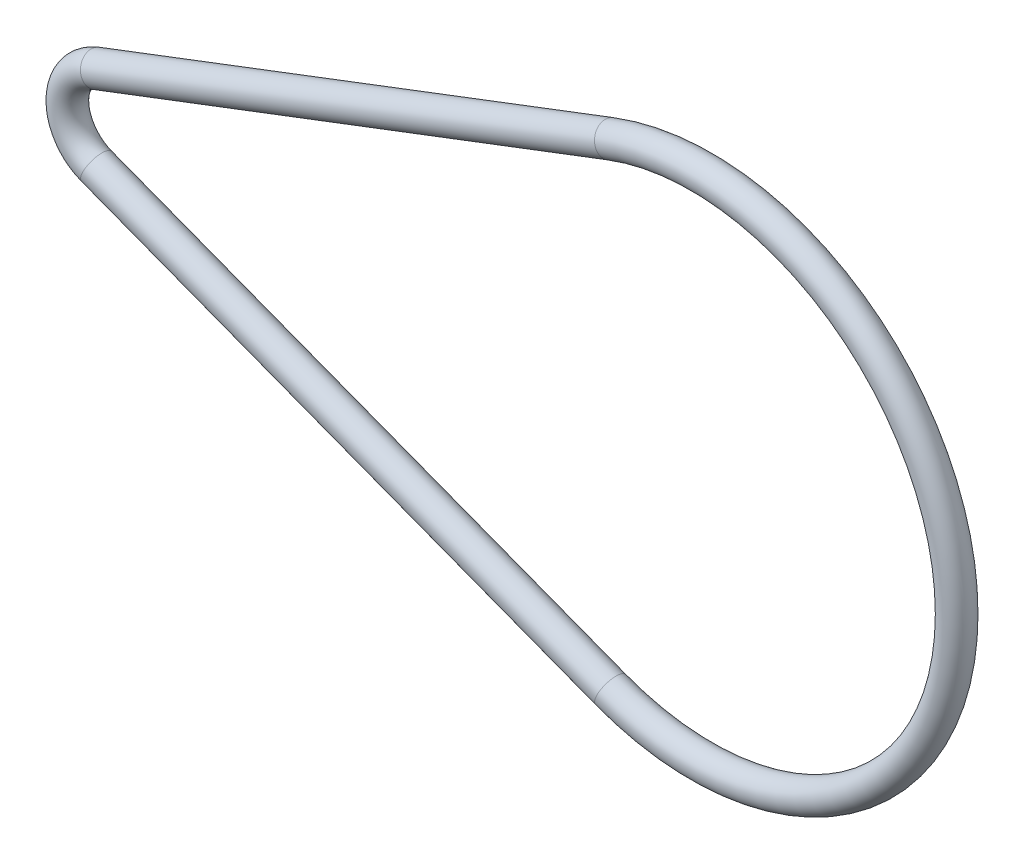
ISO-10303-21;
HEADER;
FILE_DESCRIPTION(('STEP AP214'),'2;1');
FILE_NAME('part.step','',(''),(''),'','','');
FILE_SCHEMA(('AUTOMOTIVE_DESIGN { 1 0 10303 214 1 1 1 1 }'));
ENDSEC;
DATA;
#1=APPLICATION_CONTEXT('core data for automotive mechanical design processes');
#2=APPLICATION_PROTOCOL_DEFINITION('international standard','automotive_design',2000,#1);
#3=PRODUCT_CONTEXT('',#1,'mechanical');
#4=PRODUCT('Part','Part','',(#3));
#5=PRODUCT_RELATED_PRODUCT_CATEGORY('part','',(#4));
#6=PRODUCT_DEFINITION_FORMATION('','',#4);
#7=PRODUCT_DEFINITION_CONTEXT('part definition',#1,'design');
#8=PRODUCT_DEFINITION('design','',#6,#7);
#9=PRODUCT_DEFINITION_SHAPE('','',#8);
#10=(LENGTH_UNIT() NAMED_UNIT(*) SI_UNIT(.MILLI.,.METRE.));
#11=(NAMED_UNIT(*) PLANE_ANGLE_UNIT() SI_UNIT($,.RADIAN.));
#12=(NAMED_UNIT(*) SI_UNIT($,.STERADIAN.) SOLID_ANGLE_UNIT());
#13=UNCERTAINTY_MEASURE_WITH_UNIT(LENGTH_MEASURE(1.E-05),#10,'distance_accuracy_value','');
#14=(GEOMETRIC_REPRESENTATION_CONTEXT(3) GLOBAL_UNCERTAINTY_ASSIGNED_CONTEXT((#13)) GLOBAL_UNIT_ASSIGNED_CONTEXT((#10,
#11,#12)) REPRESENTATION_CONTEXT('',''));
#15=CARTESIAN_POINT('',(0.,0.,0.));
#16=DIRECTION('',(0.,0.,1.));
#17=DIRECTION('',(1.,0.,0.));
#18=AXIS2_PLACEMENT_3D('',#15,#16,#17);
#19=CARTESIAN_POINT('',(-1.06923076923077,-2.80298868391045,0.));
#20=DIRECTION('',(0.934329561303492,-0.356410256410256,0.));
#21=DIRECTION('',(0.356410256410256,0.934329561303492,0.));
#22=AXIS2_PLACEMENT_3D('',#19,#20,#21);
#23=CYLINDRICAL_SURFACE('',#22,0.999999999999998);
#24=CARTESIAN_POINT('',(-1.06923076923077,-2.80298868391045,0.));
#25=DIRECTION('',(0.934329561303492,-0.356410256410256,0.));
#26=DIRECTION('',(0.,0.,1.));
#27=AXIS2_PLACEMENT_3D('',#24,#25,#26);
#28=CIRCLE('',#27,0.999999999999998);
#29=CARTESIAN_POINT('',(-1.42564102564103,-3.73731824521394,0.));
#30=VERTEX_POINT('',#29);
#31=EDGE_CURVE('E35',#30,#30,#28,.T.);
#32=ORIENTED_EDGE('',*,*,#31,.T.);
#33=EDGE_LOOP('',(#32));
#34=FACE_BOUND('',#33,.T.);
#35=CARTESIAN_POINT('',(32.9766666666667,-15.790169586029,0.));
#36=DIRECTION('',(0.934329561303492,-0.356410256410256,0.));
#37=DIRECTION('',(0.,0.,1.));
#38=AXIS2_PLACEMENT_3D('',#35,#36,#37);
#39=CIRCLE('',#38,0.999999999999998);
#40=CARTESIAN_POINT('',(32.6202564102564,-16.7244991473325,0.));
#41=VERTEX_POINT('',#40);
#42=EDGE_CURVE('E10',#41,#41,#39,.T.);
#43=ORIENTED_EDGE('',*,*,#42,.F.);
#44=EDGE_LOOP('',(#43));
#45=FACE_BOUND('',#44,.T.);
#46=ADVANCED_FACE('F29',(#34,#45),#23,.T.);
#47=CARTESIAN_POINT('',(0.,0.,0.));
#48=DIRECTION('',(0.,0.,1.));
#49=DIRECTION('',(1.,0.,0.));
#50=AXIS2_PLACEMENT_3D('',#47,#48,#49);
#51=TOROIDAL_SURFACE('',#50,2.99999999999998,0.999999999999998);
#52=CARTESIAN_POINT('',(-1.06923076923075,2.80298868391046,0.));
#53=DIRECTION('',(-0.934329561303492,-0.356410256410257,0.));
#54=DIRECTION('',(0.,0.,1.));
#55=AXIS2_PLACEMENT_3D('',#52,#53,#54);
#56=CIRCLE('',#55,0.999999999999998);
#57=CARTESIAN_POINT('',(-1.42564102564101,3.73731824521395,0.));
#58=VERTEX_POINT('',#57);
#59=EDGE_CURVE('E39',#58,#58,#56,.T.);
#60=CARTESIAN_POINT('',(0.,0.,0.));
#61=DIRECTION('',(0.,0.,1.));
#62=DIRECTION('',(1.,0.,0.));
#63=AXIS2_PLACEMENT_3D('',#60,#61,#62);
#64=CIRCLE('',#63,3.99999999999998);
#65=EDGE_CURVE('',#58,#30,#64,.T.);
#66=ORIENTED_EDGE('',*,*,#59,.T.);
#67=ORIENTED_EDGE('',*,*,#31,.F.);
#68=ORIENTED_EDGE('',*,*,#65,.T.);
#69=ORIENTED_EDGE('',*,*,#65,.F.);
#70=EDGE_LOOP('',(#66,#68,#67,#69));
#71=FACE_BOUND('',#70,.T.);
#72=ADVANCED_FACE('F58',(#71),#51,.T.);
#73=CARTESIAN_POINT('',(32.9766666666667,15.790169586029,0.));
#74=DIRECTION('',(-0.934329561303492,-0.356410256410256,0.));
#75=DIRECTION('',(0.356410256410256,-0.934329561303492,0.));
#76=AXIS2_PLACEMENT_3D('',#73,#74,#75);
#77=CYLINDRICAL_SURFACE('',#76,0.999999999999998);
#78=CARTESIAN_POINT('',(32.9766666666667,15.790169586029,0.));
#79=DIRECTION('',(-0.934329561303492,-0.356410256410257,0.));
#80=DIRECTION('',(0.,0.,1.));
#81=AXIS2_PLACEMENT_3D('',#78,#79,#80);
#82=CIRCLE('',#81,0.999999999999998);
#83=CARTESIAN_POINT('',(32.6202564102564,16.7244991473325,0.));
#84=VERTEX_POINT('',#83);
#85=EDGE_CURVE('E43',#84,#84,#82,.T.);
#86=ORIENTED_EDGE('',*,*,#85,.T.);
#87=EDGE_LOOP('',(#86));
#88=FACE_BOUND('',#87,.T.);
#89=ORIENTED_EDGE('',*,*,#59,.F.);
#90=EDGE_LOOP('',(#89));
#91=FACE_BOUND('',#90,.T.);
#92=ADVANCED_FACE('F49',(#88,#91),#77,.T.);
#93=CARTESIAN_POINT('',(39.,0.,0.));
#94=DIRECTION('',(0.,0.,-1.));
#95=DIRECTION('',(-1.,0.,0.));
#96=AXIS2_PLACEMENT_3D('',#93,#94,#95);
#97=TOROIDAL_SURFACE('',#96,16.9,0.999999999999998);
#98=CARTESIAN_POINT('',(39.,0.,0.));
#99=DIRECTION('',(0.,0.,-1.));
#100=DIRECTION('',(-1.,0.,0.));
#101=AXIS2_PLACEMENT_3D('',#98,#99,#100);
#102=CIRCLE('',#101,17.9);
#103=EDGE_CURVE('',#84,#41,#102,.T.);
#104=ORIENTED_EDGE('',*,*,#85,.F.);
#105=ORIENTED_EDGE('',*,*,#42,.T.);
#106=ORIENTED_EDGE('',*,*,#103,.T.);
#107=ORIENTED_EDGE('',*,*,#103,.F.);
#108=EDGE_LOOP('',(#104,#106,#105,#107));
#109=FACE_BOUND('',#108,.T.);
#110=ADVANCED_FACE('F52',(#109),#97,.T.);
#111=CLOSED_SHELL('',(#46,#72,#92,#110));
#112=MANIFOLD_SOLID_BREP('B2',#111);
#113=ADVANCED_BREP_SHAPE_REPRESENTATION('',(#18,#112),#14);
#114=SHAPE_DEFINITION_REPRESENTATION(#9,#113);
ENDSEC;
END-ISO-10303-21;
